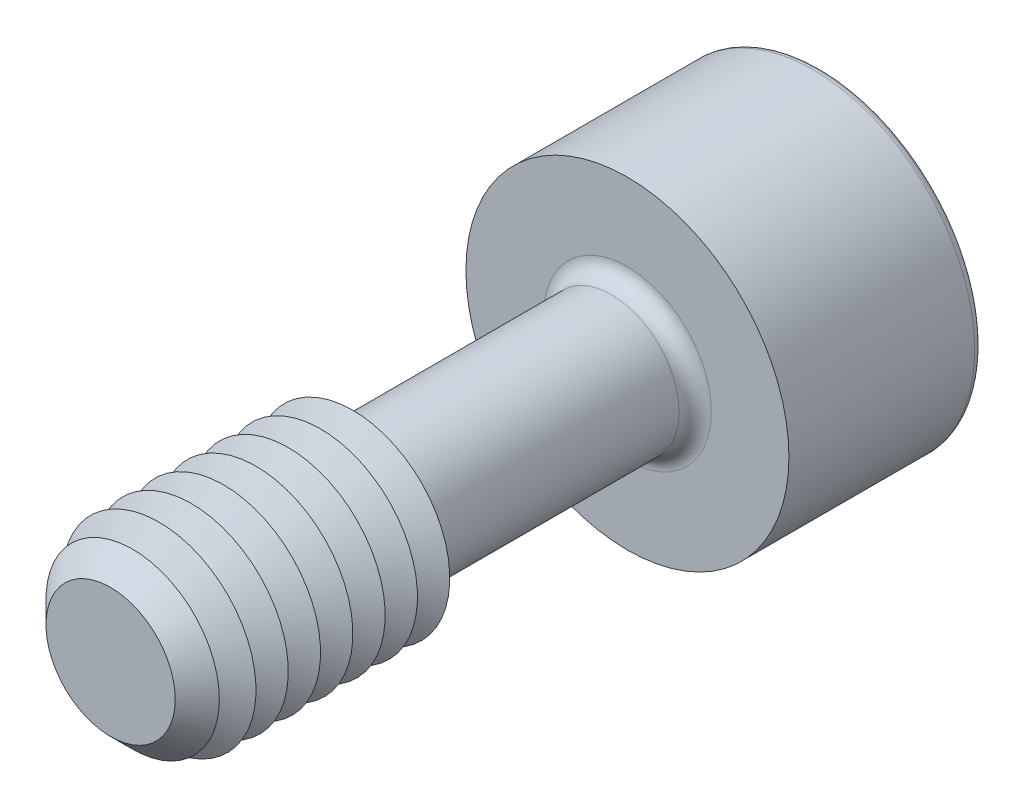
from build123d import *

# Parameters (mm, degrees)
SKETCH1_R       = 2.1
EXTRUDE1_DEPTH  = 8
CHAMFER1_SIZE   = 1
SKETCH3_R       = 5
EXTRUDE2_DEPTH  = 6
EXTRUDE3_DEPTH  = 5
FILLET1_R       = 0.5
FILLET2_R       = 0.25
LPATTERN1_COUNT = 7
LPATTERN1_PITCH = 1


with BuildPart() as part:
    # Sketch1 → Extrude1 (new, symmetric)
    with BuildSketch(Plane.XY):
        Circle(SKETCH1_R)
    extrude(amount=EXTRUDE1_DEPTH, both=True)

    # Sketch2 → Revolve1 (revolve)
    with BuildSketch(Plane(origin=(0, 0, 0), x_dir=(0, 0, -1), z_dir=(1, 0, 0))):
        Polygon((-8, 0), (-8, 3), (-0.5, 3), (0.019615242, 2.1), (0.019615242, 0), align=None)
    revolve(axis=Axis((0, 0, -0.019615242), (0, 0, 1)))

    # Chamfer1
    chamfer1_edges = [part.edges().sort_by_distance(p)[0] for p in [
        (0, -3, 8),
    ]]
    chamfer(chamfer1_edges, length=CHAMFER1_SIZE)

    # Sketch3 → Extrude2 (add)
    with BuildSketch(Plane(origin=(0, 0, -8), x_dir=(-1, 0, 0), z_dir=(0, 0, -1))):
        Circle(SKETCH3_R)
    extrude(amount=EXTRUDE2_DEPTH)

    # Sketch4 → Extrude3 (cut)
    with BuildSketch(Plane(origin=(-13.7, 0, -14), x_dir=(1, 0, 0), z_dir=(0, 0, 1))):
        Polygon((12.256624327, -2.5), (15.143375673, -2.5), (16.586751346, 0), (15.143375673, 2.5), (12.256624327, 2.5), (10.813248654, 0), align=None)
    extrude(amount=EXTRUDE3_DEPTH, mode=Mode.SUBTRACT)

    # Fillet1
    fillet1_edges = [part.edges().sort_by_distance(p)[0] for p in [
        (-2.1, 0, -8),
    ]]
    fillet(fillet1_edges, radius=FILLET1_R)

    # Fillet2
    fillet2_edges = [part.edges().sort_by_distance(p)[0] for p in [
        (5, 0, -14),
    ]]
    fillet(fillet2_edges, radius=FILLET2_R)

    # Sketch5 → Cut-Revolve1 (revolve, cut)
    with BuildSketch(Plane(origin=(0, 0, 0), x_dir=(0, 0, -1), z_dir=(1, 0, 0)), mode=Mode.PRIVATE) as cut_revolve1_sk:
        Polygon((9, 0), (9, -2.5), (7.556624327, 0), align=None)
    revolve(cut_revolve1_sk.sketch.rotate(Axis((0, 0, -7.556624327), (0, 0, -1)), 90), axis=Axis((0, 0, -7.556624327), (0, 0, -1)), mode=Mode.SUBTRACT)

    # Sketch7 → Cut-Revolve2 (revolve, cut)
    with BuildSketch(Plane(origin=(0, 0, 0), x_dir=(0, 0, -1), z_dir=(1, 0, 0)), mode=Mode.PRIVATE) as cut_revolve2_sk:
        Polygon((-0.5, 3), (-1, 2.133974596), (-1.5, 3), align=None)
    cut_revolve2 = revolve(cut_revolve2_sk.sketch.rotate(Axis((0, 0, -1.332048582), (0, 0, 1)), 90), axis=Axis((0, 0, -1.332048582), (0, 0, 1)), mode=Mode.SUBTRACT)

    # LPattern1: Cut-Revolve2 ×7
    with Locations(*[(0, 0, i * LPATTERN1_PITCH) for i in range(1, LPATTERN1_COUNT)]):
        add(cut_revolve2, mode=Mode.SUBTRACT)


solid = part.part
